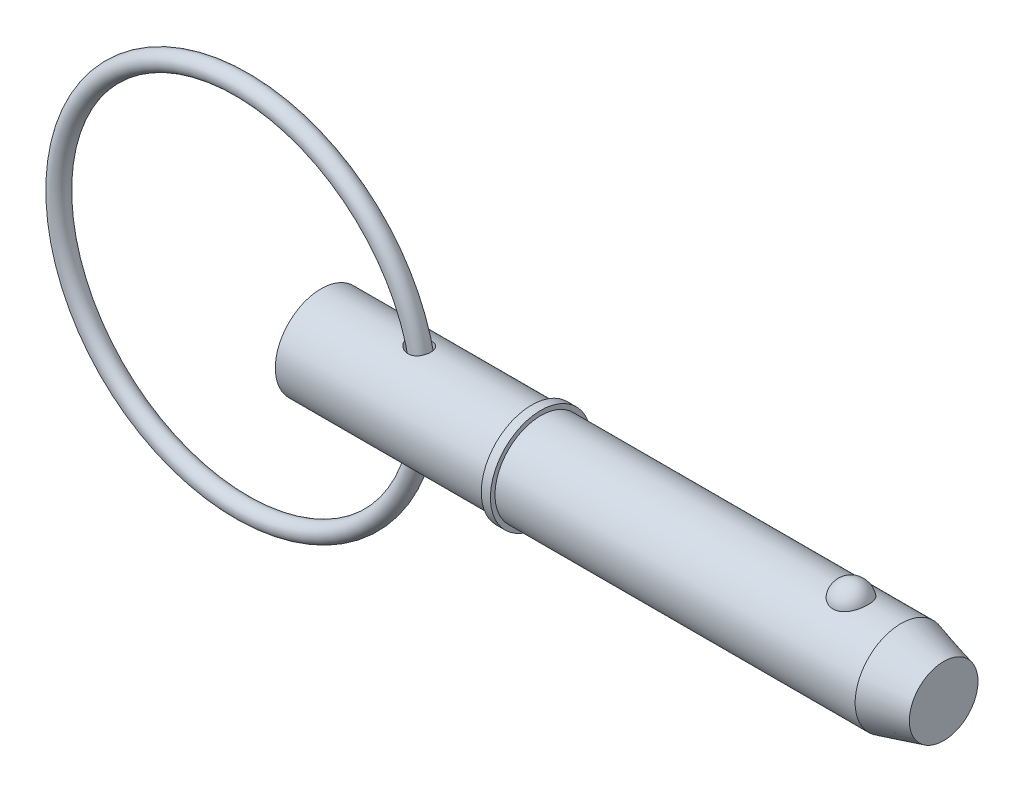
ISO-10303-21;
HEADER;
FILE_DESCRIPTION(('STEP AP214'),'2;1');
FILE_NAME('part.step','',(''),(''),'','','');
FILE_SCHEMA(('AUTOMOTIVE_DESIGN { 1 0 10303 214 1 1 1 1 }'));
ENDSEC;
DATA;
#1=APPLICATION_CONTEXT('core data for automotive mechanical design processes');
#2=APPLICATION_PROTOCOL_DEFINITION('international standard','automotive_design',2000,#1);
#3=PRODUCT_CONTEXT('',#1,'mechanical');
#4=PRODUCT('Part','Part','',(#3));
#5=PRODUCT_RELATED_PRODUCT_CATEGORY('part','',(#4));
#6=PRODUCT_DEFINITION_FORMATION('','',#4);
#7=PRODUCT_DEFINITION_CONTEXT('part definition',#1,'design');
#8=PRODUCT_DEFINITION('design','',#6,#7);
#9=PRODUCT_DEFINITION_SHAPE('','',#8);
#10=(LENGTH_UNIT() NAMED_UNIT(*) SI_UNIT(.MILLI.,.METRE.));
#11=(NAMED_UNIT(*) PLANE_ANGLE_UNIT() SI_UNIT($,.RADIAN.));
#12=(NAMED_UNIT(*) SI_UNIT($,.STERADIAN.) SOLID_ANGLE_UNIT());
#13=UNCERTAINTY_MEASURE_WITH_UNIT(LENGTH_MEASURE(1.E-05),#10,'distance_accuracy_value','');
#14=(GEOMETRIC_REPRESENTATION_CONTEXT(3) GLOBAL_UNCERTAINTY_ASSIGNED_CONTEXT((#13)) GLOBAL_UNIT_ASSIGNED_CONTEXT((#10,
#11,#12)) REPRESENTATION_CONTEXT('',''));
#15=CARTESIAN_POINT('',(0.,0.,0.));
#16=DIRECTION('',(0.,0.,1.));
#17=DIRECTION('',(1.,0.,0.));
#18=AXIS2_PLACEMENT_3D('',#15,#16,#17);
#19=CARTESIAN_POINT('',(-6.86864682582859,0.,0.));
#20=DIRECTION('',(0.,0.,1.));
#21=DIRECTION('',(1.,0.,0.));
#22=AXIS2_PLACEMENT_3D('',#19,#20,#21);
#23=TOROIDAL_SURFACE('',#22,15.875,0.794);
#24=CARTESIAN_POINT('',(9.80035317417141,0.,0.));
#25=VERTEX_POINT('',#24);
#26=VERTEX_LOOP('',#25);
#27=FACE_BOUND('',#26,.T.);
#28=ADVANCED_FACE('P0_F12',(#27),#23,.T.);
#29=CLOSED_SHELL('',(#28));
#30=MANIFOLD_SOLID_BREP('P0_B1',#29);
#31=CARTESIAN_POINT('',(0.,0.,0.));
#32=DIRECTION('',(1.,0.,0.));
#33=DIRECTION('',(0.,0.,-1.));
#34=AXIS2_PLACEMENT_3D('',#31,#32,#33);
#35=CYLINDRICAL_SURFACE('',#34,3.97);
#36=CARTESIAN_POINT('',(7.55504033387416,3.95240335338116,-0.373373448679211));
#37=CARTESIAN_POINT('',(7.57857626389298,3.94742764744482,-0.426034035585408));
#38=CARTESIAN_POINT('',(7.60690043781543,3.94158882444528,-0.476521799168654));
#39=CARTESIAN_POINT('',(7.67175252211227,3.92889627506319,-0.571840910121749));
#40=CARTESIAN_POINT('',(7.70829717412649,3.92204048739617,-0.616660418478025));
#41=CARTESIAN_POINT('',(7.7880127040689,3.90811378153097,-0.699502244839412));
#42=CARTESIAN_POINT('',(7.83115323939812,3.90104396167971,-0.737554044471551));
#43=CARTESIAN_POINT('',(7.92290500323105,3.88739302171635,-0.806417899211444));
#44=CARTESIAN_POINT('',(7.97151503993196,3.88081179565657,-0.837231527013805));
#45=CARTESIAN_POINT('',(8.07649084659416,3.86840671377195,-0.89285990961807));
#46=CARTESIAN_POINT('',(8.13315921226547,3.86266475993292,-0.917124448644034));
#47=CARTESIAN_POINT('',(8.249903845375,3.85323449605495,-0.95597423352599));
#48=CARTESIAN_POINT('',(8.30998046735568,3.84954640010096,-0.970558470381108));
#49=CARTESIAN_POINT('',(8.43159099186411,3.84477321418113,-0.989300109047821));
#50=CARTESIAN_POINT('',(8.49311729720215,3.84367671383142,-0.993503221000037));
#51=CARTESIAN_POINT('',(8.61594280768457,3.84429915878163,-0.991094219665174));
#52=CARTESIAN_POINT('',(8.67724211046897,3.84601670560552,-0.984487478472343));
#53=CARTESIAN_POINT('',(8.79355089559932,3.85191689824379,-0.961127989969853));
#54=CARTESIAN_POINT('',(8.84870898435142,3.85593011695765,-0.945070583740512));
#55=CARTESIAN_POINT('',(8.95525145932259,3.86583609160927,-0.903692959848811));
#56=CARTESIAN_POINT('',(9.00663668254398,3.87172842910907,-0.878374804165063));
#57=CARTESIAN_POINT('',(9.101933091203,3.88440641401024,-0.820440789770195));
#58=CARTESIAN_POINT('',(9.14607052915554,3.89114280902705,-0.788185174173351));
#59=CARTESIAN_POINT('',(9.22823149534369,3.90493885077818,-0.71671042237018));
#60=CARTESIAN_POINT('',(9.26625504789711,3.91199849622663,-0.677491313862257));
#61=CARTESIAN_POINT('',(9.33526828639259,3.92567450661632,-0.59313132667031));
#62=CARTESIAN_POINT('',(9.36624800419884,3.93229023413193,-0.547982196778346));
#63=CARTESIAN_POINT('',(9.42036305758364,3.94435299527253,-0.453062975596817));
#64=CARTESIAN_POINT('',(9.44349799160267,3.94979996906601,-0.403292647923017));
#65=CARTESIAN_POINT('',(9.48161154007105,3.95900091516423,-0.299892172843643));
#66=CARTESIAN_POINT('',(9.49648966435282,3.96273393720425,-0.246223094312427));
#67=CARTESIAN_POINT('',(9.51731386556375,3.96800895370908,-0.137074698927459));
#68=CARTESIAN_POINT('',(9.52325977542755,3.9695509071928,-0.0815953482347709));
#69=CARTESIAN_POINT('',(9.52608552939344,3.97028010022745,0.0297918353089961));
#70=CARTESIAN_POINT('',(9.52293563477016,3.96945961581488,0.0857004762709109));
#71=CARTESIAN_POINT('',(9.5075790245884,3.96553529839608,0.196178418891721));
#72=CARTESIAN_POINT('',(9.49537214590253,3.96243142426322,0.25074769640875));
#73=CARTESIAN_POINT('',(9.46218733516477,3.95427513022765,0.357000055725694));
#74=CARTESIAN_POINT('',(9.44120904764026,3.94922263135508,0.40868302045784));
#75=CARTESIAN_POINT('',(9.39097869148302,3.93771960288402,0.507691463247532));
#76=CARTESIAN_POINT('',(9.36172655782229,3.93126906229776,0.555016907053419));
#77=CARTESIAN_POINT('',(9.29572260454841,3.9176964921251,0.643874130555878));
#78=CARTESIAN_POINT('',(9.25898413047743,3.91057566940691,0.685416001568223));
#79=CARTESIAN_POINT('',(9.1789232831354,3.89645576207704,0.761601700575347));
#80=CARTESIAN_POINT('',(9.13560164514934,3.88945666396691,0.79624629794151));
#81=CARTESIAN_POINT('',(9.04406003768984,3.87645097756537,0.857319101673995));
#82=CARTESIAN_POINT('',(8.99589768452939,3.87043453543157,0.883831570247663));
#83=CARTESIAN_POINT('',(8.89567287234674,3.85997577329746,0.928447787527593));
#84=CARTESIAN_POINT('',(8.84361081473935,3.85553329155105,0.946552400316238));
#85=CARTESIAN_POINT('',(8.73746664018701,3.84871527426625,0.973904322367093));
#86=CARTESIAN_POINT('',(8.68340054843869,3.84632597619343,0.983210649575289));
#87=CARTESIAN_POINT('',(8.57443237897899,3.84376823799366,0.993162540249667));
#88=CARTESIAN_POINT('',(8.51953018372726,3.84360011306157,0.993806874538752));
#89=CARTESIAN_POINT('',(8.40868901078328,3.84546046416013,0.986583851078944));
#90=CARTESIAN_POINT('',(8.35276804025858,3.84755469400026,0.97846170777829));
#91=CARTESIAN_POINT('',(8.24293801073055,3.85374731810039,0.953777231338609));
#92=CARTESIAN_POINT('',(8.18902962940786,3.85784638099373,0.937212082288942));
#93=CARTESIAN_POINT('',(8.08103474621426,3.86789936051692,0.894850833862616));
#94=CARTESIAN_POINT('',(8.02716623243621,3.87395687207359,0.868522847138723));
#95=CARTESIAN_POINT('',(7.92444974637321,3.88711632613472,0.807586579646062));
#96=CARTESIAN_POINT('',(7.87560399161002,3.89421872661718,0.7729746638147));
#97=CARTESIAN_POINT('',(7.7825771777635,3.90895350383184,0.694712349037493));
#98=CARTESIAN_POINT('',(7.73864194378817,3.916595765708,0.650769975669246));
#99=CARTESIAN_POINT('',(7.65930793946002,3.93121788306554,0.555638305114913));
#100=CARTESIAN_POINT('',(7.62390591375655,3.93819799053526,0.504451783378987));
#101=CARTESIAN_POINT('',(7.56512704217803,3.95020492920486,0.399268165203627));
#102=CARTESIAN_POINT('',(7.54117152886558,3.95532161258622,0.345606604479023));
#103=CARTESIAN_POINT('',(7.5037545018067,3.96345177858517,0.234589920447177));
#104=CARTESIAN_POINT('',(7.49028363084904,3.96646713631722,0.177238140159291));
#105=CARTESIAN_POINT('',(7.4756155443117,3.96976030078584,0.0675802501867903));
#106=CARTESIAN_POINT('',(7.47319553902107,3.97031070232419,0.0154431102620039));
#107=CARTESIAN_POINT('',(7.47743162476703,3.96935406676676,-0.0884045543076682));
#108=CARTESIAN_POINT('',(7.48407724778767,3.96784940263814,-0.14011550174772));
#109=CARTESIAN_POINT('',(7.50184406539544,3.96390208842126,-0.222210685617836));
#110=CARTESIAN_POINT('',(7.51030342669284,3.96203347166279,-0.253229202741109));
#111=CARTESIAN_POINT('',(7.53036279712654,3.95766645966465,-0.314179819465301));
#112=CARTESIAN_POINT('',(7.5419623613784,3.9551681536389,-0.344112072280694));
#113=CARTESIAN_POINT('',(7.55504033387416,3.95240335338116,-0.373373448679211));
#114=B_SPLINE_CURVE_WITH_KNOTS('',3,(#36,#37,#38,#39,#40,#41,#42,#43,#44,#45,#46,#47,#48,#49,
#50,#51,#52,#53,#54,#55,#56,#57,#58,#59,#60,#61,#62,#63,#64,#65,#66,#67,#68,#69,#70,#71,#72,#73,
#74,#75,#76,#77,#78,#79,#80,#81,#82,#83,#84,#85,#86,#87,#88,#89,#90,#91,#92,#93,#94,#95,#96,#97,
#98,#99,#100,#101,#102,#103,#104,#105,#106,#107,#108,#109,#110,#111,#112,#113),.UNSPECIFIED.,
.T.,.F.,(4,2,2,2,2,2,2,2,2,2,2,2,2,2,2,2,2,2,2,2,2,2,2,2,2,2,2,2,2,2,2,2,2,2,2,2,2,2,4),(0.,
0.173554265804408,0.347465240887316,0.520599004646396,0.693695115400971,0.878558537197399,
1.0634412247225,1.24750837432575,1.43148407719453,1.60336872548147,1.77521512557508,
1.93967886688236,2.10414195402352,2.26883635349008,2.43353918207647,2.60020488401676,
2.76687370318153,2.93408806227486,3.10130543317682,3.26852958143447,3.43575504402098,
3.60268496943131,3.76959626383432,3.93471461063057,4.0998159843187,4.26380184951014,
4.42781098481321,4.5967184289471,4.76568224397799,4.94567321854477,5.12574332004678,
5.31261375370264,5.49941278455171,5.67537040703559,5.85117081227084,6.00695555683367,
6.16256057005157,6.25901137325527,6.35544851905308),.UNSPECIFIED.);
#115=CARTESIAN_POINT('',(7.55504033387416,3.95240335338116,-0.373373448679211));
#116=VERTEX_POINT('',#115);
#117=EDGE_CURVE('P1_E42',#116,#116,#114,.T.);
#118=ORIENTED_EDGE('',*,*,#117,.T.);
#119=EDGE_LOOP('',(#118));
#120=FACE_BOUND('',#119,.T.);
#121=CARTESIAN_POINT('',(0.,0.,0.));
#122=DIRECTION('',(1.,0.,0.));
#123=DIRECTION('',(0.,0.,-1.));
#124=AXIS2_PLACEMENT_3D('',#121,#122,#123);
#125=CIRCLE('',#124,3.97);
#126=CARTESIAN_POINT('',(0.,0.,-3.97));
#127=VERTEX_POINT('',#126);
#128=EDGE_CURVE('P1_E9',#127,#127,#125,.T.);
#129=ORIENTED_EDGE('',*,*,#128,.T.);
#130=EDGE_LOOP('',(#129));
#131=FACE_BOUND('',#130,.T.);
#132=CARTESIAN_POINT('',(18.256,0.,0.));
#133=DIRECTION('',(1.,0.,0.));
#134=DIRECTION('',(0.,0.,-1.));
#135=AXIS2_PLACEMENT_3D('',#132,#133,#134);
#136=CIRCLE('',#135,3.97);
#137=CARTESIAN_POINT('',(18.256,0.,-3.97));
#138=VERTEX_POINT('',#137);
#139=EDGE_CURVE('P1_E25',#138,#138,#136,.T.);
#140=ORIENTED_EDGE('',*,*,#139,.F.);
#141=EDGE_LOOP('',(#140));
#142=FACE_BOUND('',#141,.T.);
#143=CARTESIAN_POINT('',(7.55504033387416,-3.95240335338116,-0.373373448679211));
#144=CARTESIAN_POINT('',(7.53460920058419,-3.95672239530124,-0.327655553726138));
#145=CARTESIAN_POINT('',(7.51777420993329,-3.96039298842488,-0.280271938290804));
#146=CARTESIAN_POINT('',(7.49205527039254,-3.96606288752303,-0.183298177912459));
#147=CARTESIAN_POINT('',(7.48316724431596,-3.96806305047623,-0.133709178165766));
#148=CARTESIAN_POINT('',(7.47379315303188,-3.9701737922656,-0.0336103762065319));
#149=CARTESIAN_POINT('',(7.47332172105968,-3.97028108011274,0.0169008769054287));
#150=CARTESIAN_POINT('',(7.48084392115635,-3.96858544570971,0.11725681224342));
#151=CARTESIAN_POINT('',(7.48883849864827,-3.96678231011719,0.167101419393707));
#152=CARTESIAN_POINT('',(7.51265320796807,-3.96151492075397,0.263832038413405));
#153=CARTESIAN_POINT('',(7.52833209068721,-3.95808068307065,0.310754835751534));
#154=CARTESIAN_POINT('',(7.56673745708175,-3.94990960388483,0.401487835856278));
#155=CARTESIAN_POINT('',(7.58946563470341,-3.94517244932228,0.44529728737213));
#156=CARTESIAN_POINT('',(7.64284475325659,-3.93448395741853,0.53175081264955));
#157=CARTESIAN_POINT('',(7.67392233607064,-3.92847279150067,0.57412324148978));
#158=CARTESIAN_POINT('',(7.74208866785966,-3.91602761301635,0.653644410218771));
#159=CARTESIAN_POINT('',(7.77918016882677,-3.90959340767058,0.690790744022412));
#160=CARTESIAN_POINT('',(7.86273878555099,-3.89617013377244,0.763056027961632));
#161=CARTESIAN_POINT('',(7.90978795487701,-3.88919756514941,0.797506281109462));
#162=CARTESIAN_POINT('',(8.00882206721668,-3.87616232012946,0.858629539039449));
#163=CARTESIAN_POINT('',(8.06080923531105,-3.87010005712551,0.885299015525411));
#164=CARTESIAN_POINT('',(8.17187138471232,-3.85921766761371,0.931635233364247));
#165=CARTESIAN_POINT('',(8.23118658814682,-3.85449995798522,0.950754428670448));
#166=CARTESIAN_POINT('',(8.35233947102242,-3.84749758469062,0.97871022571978));
#167=CARTESIAN_POINT('',(8.41417663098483,-3.84521242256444,0.987548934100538));
#168=CARTESIAN_POINT('',(8.53665727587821,-3.84349493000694,0.994212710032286));
#169=CARTESIAN_POINT('',(8.59728174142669,-3.84397996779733,0.99235677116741));
#170=CARTESIAN_POINT('',(8.71718393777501,-3.84764343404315,0.978056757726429));
#171=CARTESIAN_POINT('',(8.77646227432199,-3.8508206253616,0.965617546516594));
#172=CARTESIAN_POINT('',(8.88778602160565,-3.85921632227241,0.931467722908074));
#173=CARTESIAN_POINT('',(8.94005016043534,-3.864284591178,0.91043061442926));
#174=CARTESIAN_POINT('',(9.04004360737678,-3.87587542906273,0.85974532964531));
#175=CARTESIAN_POINT('',(9.08777352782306,-3.88239780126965,0.830098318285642));
#176=CARTESIAN_POINT('',(9.17600506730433,-3.895934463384,0.763999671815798));
#177=CARTESIAN_POINT('',(9.21667512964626,-3.90292920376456,0.727768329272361));
#178=CARTESIAN_POINT('',(9.29136502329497,-3.91679963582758,0.648981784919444));
#179=CARTESIAN_POINT('',(9.32538470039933,-3.92367532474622,0.606426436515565));
#180=CARTESIAN_POINT('',(9.38618865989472,-3.9366168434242,0.515806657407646));
#181=CARTESIAN_POINT('',(9.4129117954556,-3.9426756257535,0.467700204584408));
#182=CARTESIAN_POINT('',(9.45812227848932,-3.95326415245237,0.367605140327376));
#183=CARTESIAN_POINT('',(9.47660924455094,-3.95779382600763,0.315616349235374));
#184=CARTESIAN_POINT('',(9.50505994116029,-3.96487773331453,0.208669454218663));
#185=CARTESIAN_POINT('',(9.51493710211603,-3.96741187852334,0.153686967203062));
#186=CARTESIAN_POINT('',(9.52562221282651,-3.97015680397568,0.0427905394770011));
#187=CARTESIAN_POINT('',(9.52643004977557,-3.97036755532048,-0.0131234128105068));
#188=CARTESIAN_POINT('',(9.51895215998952,-3.96844170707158,-0.124381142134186));
#189=CARTESIAN_POINT('',(9.51065320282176,-3.96630169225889,-0.179723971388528));
#190=CARTESIAN_POINT('',(9.48513477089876,-3.95989913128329,-0.288186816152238));
#191=CARTESIAN_POINT('',(9.46791509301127,-3.95563653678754,-0.341306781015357));
#192=CARTESIAN_POINT('',(9.42495956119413,-3.94545061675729,-0.443818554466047));
#193=CARTESIAN_POINT('',(9.39922309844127,-3.93952717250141,-0.493210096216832));
#194=CARTESIAN_POINT('',(9.33985370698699,-3.92667071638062,-0.586850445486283));
#195=CARTESIAN_POINT('',(9.30622091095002,-3.91973772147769,-0.631099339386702));
#196=CARTESIAN_POINT('',(9.23204774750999,-3.9056660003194,-0.713019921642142));
#197=CARTESIAN_POINT('',(9.19153441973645,-3.89852816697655,-0.750716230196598));
#198=CARTESIAN_POINT('',(9.10459278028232,-3.88483152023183,-0.818650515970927));
#199=CARTESIAN_POINT('',(9.05816529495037,-3.87827262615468,-0.848889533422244));
#200=CARTESIAN_POINT('',(8.96131655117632,-3.86655481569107,-0.900752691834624));
#201=CARTESIAN_POINT('',(8.91095192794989,-3.86137955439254,-0.922478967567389));
#202=CARTESIAN_POINT('',(8.8071927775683,-3.85288425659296,-0.957343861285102));
#203=CARTESIAN_POINT('',(8.75379837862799,-3.84956414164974,-0.97048284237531));
#204=CARTESIAN_POINT('',(8.64548182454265,-3.84510108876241,-0.988018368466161));
#205=CARTESIAN_POINT('',(8.59055875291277,-3.84395948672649,-0.992409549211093));
#206=CARTESIAN_POINT('',(8.48070473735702,-3.84391315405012,-0.992587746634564));
#207=CARTESIAN_POINT('',(8.42577379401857,-3.84500886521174,-0.988373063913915));
#208=CARTESIAN_POINT('',(8.31494327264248,-3.84934404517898,-0.971354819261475));
#209=CARTESIAN_POINT('',(8.25910274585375,-3.85267319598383,-0.958191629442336));
#210=CARTESIAN_POINT('',(8.15023512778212,-3.86114252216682,-0.923469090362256));
#211=CARTESIAN_POINT('',(8.09720922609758,-3.86628345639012,-0.901906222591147));
#212=CARTESIAN_POINT('',(7.9918189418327,-3.87819313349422,-0.849289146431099));
#213=CARTESIAN_POINT('',(7.93972943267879,-3.88504694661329,-0.817702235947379));
#214=CARTESIAN_POINT('',(7.84154327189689,-3.89937910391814,-0.746366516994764));
#215=CARTESIAN_POINT('',(7.79544783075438,-3.90685757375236,-0.706616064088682));
#216=CARTESIAN_POINT('',(7.71208259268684,-3.92134227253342,-0.621122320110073));
#217=CARTESIAN_POINT('',(7.67457985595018,-3.92835595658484,-0.57560820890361));
#218=CARTESIAN_POINT('',(7.60807883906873,-3.94134589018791,-0.478617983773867));
#219=CARTESIAN_POINT('',(7.57907194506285,-3.94732318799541,-0.427147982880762));
#220=CARTESIAN_POINT('',(7.55504033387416,-3.95240335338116,-0.373373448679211));
#221=B_SPLINE_CURVE_WITH_KNOTS('',3,(#143,#144,#145,#146,#147,#148,#149,#150,#151,#152,#153,
#154,#155,#156,#157,#158,#159,#160,#161,#162,#163,#164,#165,#166,#167,#168,#169,#170,#171,#172,
#173,#174,#175,#176,#177,#178,#179,#180,#181,#182,#183,#184,#185,#186,#187,#188,#189,#190,#191,
#192,#193,#194,#195,#196,#197,#198,#199,#200,#201,#202,#203,#204,#205,#206,#207,#208,#209,#210,
#211,#212,#213,#214,#215,#216,#217,#218,#219,#220),.UNSPECIFIED.,.T.,.F.,(4,2,2,2,2,2,2,2,2,2,2,
2,2,2,2,2,2,2,2,2,2,2,2,2,2,2,2,2,2,2,2,2,2,2,2,2,2,2,4),(0.,0.150601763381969,
0.301126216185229,0.451912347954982,0.602715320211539,0.750844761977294,0.899009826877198,
1.05703657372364,1.21513583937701,1.39056726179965,1.56607811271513,1.75265499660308,
1.93919364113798,2.12019769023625,2.30111860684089,2.46997605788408,2.63881067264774,
2.80278822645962,2.96676958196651,3.13208567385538,3.29740942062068,3.46437689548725,
3.63134644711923,3.79855889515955,3.96577515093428,4.13300336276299,4.30022876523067,
4.46681158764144,4.63337115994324,4.79786624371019,4.96235437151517,5.12694333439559,
5.29156480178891,5.46322695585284,5.63496109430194,5.81803489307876,6.00114560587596,
6.1784675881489,6.35560915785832),.UNSPECIFIED.);
#222=CARTESIAN_POINT('',(7.55504033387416,-3.95240335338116,-0.373373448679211));
#223=VERTEX_POINT('',#222);
#224=EDGE_CURVE('P1_E17',#223,#223,#221,.T.);
#225=ORIENTED_EDGE('',*,*,#224,.T.);
#226=EDGE_LOOP('',(#225));
#227=FACE_BOUND('',#226,.T.);
#228=ADVANCED_FACE('P1_F13',(#120,#131,#142,#227),#35,.T.);
#229=CARTESIAN_POINT('',(0.,0.,0.));
#230=DIRECTION('',(1.,0.,0.));
#231=DIRECTION('',(0.,0.,-1.));
#232=AXIS2_PLACEMENT_3D('',#229,#230,#231);
#233=CYLINDRICAL_SURFACE('',#232,3.97);
#234=CARTESIAN_POINT('',(50.2759395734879,0.,0.));
#235=DIRECTION('',(1.,0.,0.));
#236=DIRECTION('',(0.,0.,-1.));
#237=AXIS2_PLACEMENT_3D('',#234,#235,#236);
#238=CIRCLE('',#237,3.97);
#239=CARTESIAN_POINT('',(50.2759395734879,0.,-3.97));
#240=VERTEX_POINT('',#239);
#241=EDGE_CURVE('P1_E99',#240,#240,#238,.T.);
#242=ORIENTED_EDGE('',*,*,#241,.F.);
#243=EDGE_LOOP('',(#242));
#244=FACE_BOUND('',#243,.T.);
#245=CARTESIAN_POINT('',(19.05,0.,0.));
#246=DIRECTION('',(1.,0.,0.));
#247=DIRECTION('',(0.,0.,-1.));
#248=AXIS2_PLACEMENT_3D('',#245,#246,#247);
#249=CIRCLE('',#248,3.97);
#250=CARTESIAN_POINT('',(19.05,0.,-3.97));
#251=VERTEX_POINT('',#250);
#252=EDGE_CURVE('P1_E96',#251,#251,#249,.T.);
#253=ORIENTED_EDGE('',*,*,#252,.T.);
#254=EDGE_LOOP('',(#253));
#255=FACE_BOUND('',#254,.T.);
#256=CARTESIAN_POINT('',(45.9451922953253,3.65715365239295,1.54470941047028));
#257=CARTESIAN_POINT('',(45.8652448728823,3.65716001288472,1.54470290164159));
#258=CARTESIAN_POINT('',(45.7851650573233,3.65987074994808,1.53832549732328));
#259=CARTESIAN_POINT('',(45.6272374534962,3.6704221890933,1.51297018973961));
#260=CARTESIAN_POINT('',(45.5493961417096,3.67827646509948,1.49395894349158));
#261=CARTESIAN_POINT('',(45.3984614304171,3.69818848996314,1.44395950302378));
#262=CARTESIAN_POINT('',(45.3253560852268,3.71023513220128,1.41300293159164));
#263=CARTESIAN_POINT('',(45.1855630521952,3.7372183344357,1.34000212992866));
#264=CARTESIAN_POINT('',(45.1188725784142,3.75215363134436,1.29796274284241));
#265=CARTESIAN_POINT('',(44.9914886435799,3.78384968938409,1.20248834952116));
#266=CARTESIAN_POINT('',(44.9310299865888,3.80065129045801,1.14875388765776));
#267=CARTESIAN_POINT('',(44.8196942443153,3.83398532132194,1.03205417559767));
#268=CARTESIAN_POINT('',(44.7688200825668,3.85051766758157,0.969086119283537));
#269=CARTESIAN_POINT('',(44.6756321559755,3.88238608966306,0.832526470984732));
#270=CARTESIAN_POINT('',(44.6337961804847,3.89763698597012,0.758588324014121));
#271=CARTESIAN_POINT('',(44.5625108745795,3.92451063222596,0.60435211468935));
#272=CARTESIAN_POINT('',(44.5330623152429,3.93613315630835,0.524053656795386));
#273=CARTESIAN_POINT('',(44.4868927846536,3.95467606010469,0.358403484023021));
#274=CARTESIAN_POINT('',(44.4703127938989,3.96154426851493,0.273006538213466));
#275=CARTESIAN_POINT('',(44.450756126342,3.96967008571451,0.100408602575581));
#276=CARTESIAN_POINT('',(44.4477789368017,3.97092790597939,0.0132076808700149));
#277=CARTESIAN_POINT('',(44.4554587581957,3.96771794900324,-0.159844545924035));
#278=CARTESIAN_POINT('',(44.4660164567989,3.96329187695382,-0.245701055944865));
#279=CARTESIAN_POINT('',(44.5003800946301,3.94923163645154,-0.414277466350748));
#280=CARTESIAN_POINT('',(44.5241862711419,3.93959737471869,-0.496997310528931));
#281=CARTESIAN_POINT('',(44.5846114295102,3.91607752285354,-0.657113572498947));
#282=CARTESIAN_POINT('',(44.6212495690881,3.90218558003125,-0.734501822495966));
#283=CARTESIAN_POINT('',(44.7065935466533,3.87158287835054,-0.881704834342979));
#284=CARTESIAN_POINT('',(44.7553004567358,3.8548718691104,-0.951518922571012));
#285=CARTESIAN_POINT('',(44.8641161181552,3.82028735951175,-1.08208159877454));
#286=CARTESIAN_POINT('',(44.9242955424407,3.80240713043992,-1.14276958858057));
#287=CARTESIAN_POINT('',(45.054493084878,3.76758161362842,-1.2528243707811));
#288=CARTESIAN_POINT('',(45.1245105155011,3.75063626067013,-1.30219195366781));
#289=CARTESIAN_POINT('',(45.27118160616,3.71998948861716,-1.38729709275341));
#290=CARTESIAN_POINT('',(45.3476813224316,3.70623183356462,-1.42327904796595));
#291=CARTESIAN_POINT('',(45.5062981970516,3.68323188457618,-1.48178996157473));
#292=CARTESIAN_POINT('',(45.5884132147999,3.67398788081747,-1.5043240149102));
#293=CARTESIAN_POINT('',(45.7514810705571,3.6615216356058,-1.53440939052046));
#294=CARTESIAN_POINT('',(45.8322840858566,3.65801951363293,-1.54265826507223));
#295=CARTESIAN_POINT('',(45.9942085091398,3.65657341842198,-1.54608423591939));
#296=CARTESIAN_POINT('',(46.0753298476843,3.65862829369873,-1.54126404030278));
#297=CARTESIAN_POINT('',(46.2328122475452,3.66788969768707,-1.51908474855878));
#298=CARTESIAN_POINT('',(46.3092422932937,3.67492621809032,-1.50213925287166));
#299=CARTESIAN_POINT('',(46.4580412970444,3.69318404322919,-1.45666982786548));
#300=CARTESIAN_POINT('',(46.5304099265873,3.70440568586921,-1.42814496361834));
#301=CARTESIAN_POINT('',(46.6708029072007,3.73012749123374,-1.35956319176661));
#302=CARTESIAN_POINT('',(46.7387000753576,3.74469307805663,-1.31927107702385));
#303=CARTESIAN_POINT('',(46.8668649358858,3.77545272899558,-1.22847440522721));
#304=CARTESIAN_POINT('',(46.9271308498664,3.79164717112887,-1.17796747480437));
#305=CARTESIAN_POINT('',(47.0416346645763,3.82490325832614,-1.06519260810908));
#306=CARTESIAN_POINT('',(47.0954137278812,3.84196735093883,-1.00245914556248));
#307=CARTESIAN_POINT('',(47.1920988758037,3.87439863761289,-0.868715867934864));
#308=CARTESIAN_POINT('',(47.2350030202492,3.88976552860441,-0.797704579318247));
#309=CARTESIAN_POINT('',(47.310266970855,3.91771381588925,-0.646896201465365));
#310=CARTESIAN_POINT('',(47.3422532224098,3.93019255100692,-0.566893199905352));
#311=CARTESIAN_POINT('',(47.3931101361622,3.95043886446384,-0.40225513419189));
#312=CARTESIAN_POINT('',(47.4119807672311,3.95820643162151,-0.317620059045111));
#313=CARTESIAN_POINT('',(47.4362162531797,3.96823733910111,-0.14615699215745));
#314=CARTESIAN_POINT('',(47.4415874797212,3.970503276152,-0.0593300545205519));
#315=CARTESIAN_POINT('',(47.4387309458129,3.96930811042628,0.114057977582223));
#316=CARTESIAN_POINT('',(47.4305035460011,3.9658471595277,0.200619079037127));
#317=CARTESIAN_POINT('',(47.4007063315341,3.95358562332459,0.370506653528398));
#318=CARTESIAN_POINT('',(47.3792129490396,3.94481563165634,0.453848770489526));
#319=CARTESIAN_POINT('',(47.3233839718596,3.92284586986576,0.615497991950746));
#320=CARTESIAN_POINT('',(47.2890474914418,3.90964579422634,0.693804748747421));
#321=CARTESIAN_POINT('',(47.2079702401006,3.88006987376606,0.843703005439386));
#322=CARTESIAN_POINT('',(47.1611536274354,3.86367478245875,0.915249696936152));
#323=CARTESIAN_POINT('',(47.0561897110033,3.82949741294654,1.04910810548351));
#324=CARTESIAN_POINT('',(46.9980428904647,3.81171519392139,1.11142021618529));
#325=CARTESIAN_POINT('',(46.8717433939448,3.77673366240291,1.22503948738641));
#326=CARTESIAN_POINT('',(46.8035970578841,3.75953398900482,1.27635357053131));
#327=CARTESIAN_POINT('',(46.6589009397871,3.72770506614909,1.36653336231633));
#328=CARTESIAN_POINT('',(46.582348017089,3.71307678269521,1.40539439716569));
#329=CARTESIAN_POINT('',(46.4257594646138,3.68864287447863,1.46830480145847));
#330=CARTESIAN_POINT('',(46.3459307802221,3.67869017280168,1.49281289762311));
#331=CARTESIAN_POINT('',(46.1829877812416,3.66414535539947,1.52817474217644));
#332=CARTESIAN_POINT('',(46.0998840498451,3.65953723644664,1.53906926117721));
#333=CARTESIAN_POINT('',(45.9927760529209,3.6573894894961,1.54414878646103));
#334=CARTESIAN_POINT('',(45.9689900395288,3.65715175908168,1.54471134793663));
#335=CARTESIAN_POINT('',(45.9451922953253,3.65715365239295,1.54470941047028));
#336=B_SPLINE_CURVE_WITH_KNOTS('',3,(#256,#257,#258,#259,#260,#261,#262,#263,#264,#265,#266,
#267,#268,#269,#270,#271,#272,#273,#274,#275,#276,#277,#278,#279,#280,#281,#282,#283,#284,#285,
#286,#287,#288,#289,#290,#291,#292,#293,#294,#295,#296,#297,#298,#299,#300,#301,#302,#303,#304,
#305,#306,#307,#308,#309,#310,#311,#312,#313,#314,#315,#316,#317,#318,#319,#320,#321,#322,#323,
#324,#325,#326,#327,#328,#329,#330,#331,#332,#333,#334,#335),.UNSPECIFIED.,.T.,.F.,(4,2,2,2,2,2,
2,2,2,2,2,2,2,2,2,2,2,2,2,2,2,2,2,2,2,2,2,2,2,2,2,2,2,2,2,2,2,2,2,4),(0.,0.239777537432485,
0.480190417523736,0.719971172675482,0.959647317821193,1.20639040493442,1.45320863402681,
1.7109367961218,1.96868099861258,2.22921052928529,2.48973023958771,2.74834928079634,
3.00697295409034,3.26598440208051,3.52501886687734,3.78570385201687,4.04637062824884,
4.30201257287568,4.55755760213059,4.80022994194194,5.04285200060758,5.27757006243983,
5.51230707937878,5.75210128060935,5.99195126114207,6.24392810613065,6.49594987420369,
6.75588818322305,7.01582710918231,7.27564332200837,7.53545264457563,7.79377886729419,
8.0521229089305,8.31207418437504,8.57201437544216,8.83179046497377,9.09166393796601,
9.34270057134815,9.59298357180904,9.66435753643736),.UNSPECIFIED.);
#337=CARTESIAN_POINT('',(45.9451922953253,3.65715365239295,1.54470941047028));
#338=VERTEX_POINT('',#337);
#339=EDGE_CURVE('P1_E34',#338,#338,#336,.T.);
#340=ORIENTED_EDGE('',*,*,#339,.T.);
#341=EDGE_LOOP('',(#340));
#342=FACE_BOUND('',#341,.T.);
#343=ADVANCED_FACE('P1_F46',(#244,#255,#342),#233,.T.);
#344=CARTESIAN_POINT('',(0.,0.,0.));
#345=DIRECTION('',(-1.,0.,0.));
#346=DIRECTION('',(0.,0.,1.));
#347=AXIS2_PLACEMENT_3D('',#344,#345,#346);
#348=PLANE('',#347);
#349=ORIENTED_EDGE('',*,*,#128,.F.);
#350=EDGE_LOOP('',(#349));
#351=FACE_BOUND('',#350,.T.);
#352=ADVANCED_FACE('P1_F15',(#351),#348,.T.);
#353=CARTESIAN_POINT('',(18.256,3.97,0.));
#354=DIRECTION('',(-1.,0.,0.));
#355=DIRECTION('',(0.,0.,1.));
#356=AXIS2_PLACEMENT_3D('',#353,#354,#355);
#357=PLANE('',#356);
#358=ORIENTED_EDGE('',*,*,#139,.T.);
#359=EDGE_LOOP('',(#358));
#360=FACE_BOUND('',#359,.T.);
#361=CARTESIAN_POINT('',(18.256,0.,0.));
#362=DIRECTION('',(1.,0.,0.));
#363=DIRECTION('',(0.,0.,-1.));
#364=AXIS2_PLACEMENT_3D('',#361,#362,#363);
#365=CIRCLE('',#364,4.367);
#366=CARTESIAN_POINT('',(18.256,0.,-4.367));
#367=VERTEX_POINT('',#366);
#368=EDGE_CURVE('P1_E30',#367,#367,#365,.T.);
#369=ORIENTED_EDGE('',*,*,#368,.F.);
#370=EDGE_LOOP('',(#369));
#371=FACE_BOUND('',#370,.T.);
#372=ADVANCED_FACE('P1_F81',(#360,#371),#357,.T.);
#373=CARTESIAN_POINT('',(0.,0.,0.));
#374=DIRECTION('',(1.,0.,0.));
#375=DIRECTION('',(0.,0.,-1.));
#376=AXIS2_PLACEMENT_3D('',#373,#374,#375);
#377=CYLINDRICAL_SURFACE('',#376,4.367);
#378=ORIENTED_EDGE('',*,*,#368,.T.);
#379=EDGE_LOOP('',(#378));
#380=FACE_BOUND('',#379,.T.);
#381=CARTESIAN_POINT('',(19.05,0.,0.));
#382=DIRECTION('',(1.,0.,0.));
#383=DIRECTION('',(0.,0.,-1.));
#384=AXIS2_PLACEMENT_3D('',#381,#382,#383);
#385=CIRCLE('',#384,4.367);
#386=CARTESIAN_POINT('',(19.05,0.,-4.367));
#387=VERTEX_POINT('',#386);
#388=EDGE_CURVE('P1_E95',#387,#387,#385,.T.);
#389=ORIENTED_EDGE('',*,*,#388,.F.);
#390=EDGE_LOOP('',(#389));
#391=FACE_BOUND('',#390,.T.);
#392=ADVANCED_FACE('P1_F68',(#380,#391),#377,.T.);
#393=CARTESIAN_POINT('',(19.05,4.367,0.));
#394=DIRECTION('',(1.,0.,0.));
#395=DIRECTION('',(0.,0.,-1.));
#396=AXIS2_PLACEMENT_3D('',#393,#394,#395);
#397=PLANE('',#396);
#398=ORIENTED_EDGE('',*,*,#388,.T.);
#399=EDGE_LOOP('',(#398));
#400=FACE_BOUND('',#399,.T.);
#401=ORIENTED_EDGE('',*,*,#252,.F.);
#402=EDGE_LOOP('',(#401));
#403=FACE_BOUND('',#402,.T.);
#404=ADVANCED_FACE('P1_F62',(#400,#403),#397,.T.);
#405=CARTESIAN_POINT('',(53.98,0.,0.));
#406=DIRECTION('',(-1.,0.,0.));
#407=DIRECTION('',(0.,0.,1.));
#408=AXIS2_PLACEMENT_3D('',#405,#406,#407);
#409=CONICAL_SURFACE('',#408,2.97750000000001,0.26179938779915);
#410=ORIENTED_EDGE('',*,*,#241,.T.);
#411=EDGE_LOOP('',(#410));
#412=FACE_BOUND('',#411,.T.);
#413=CARTESIAN_POINT('',(53.98,0.,0.));
#414=DIRECTION('',(1.,0.,0.));
#415=DIRECTION('',(0.,0.,-1.));
#416=AXIS2_PLACEMENT_3D('',#413,#414,#415);
#417=CIRCLE('',#416,2.97750000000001);
#418=CARTESIAN_POINT('',(53.98,0.,-2.97750000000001));
#419=VERTEX_POINT('',#418);
#420=EDGE_CURVE('P1_E41',#419,#419,#417,.T.);
#421=ORIENTED_EDGE('',*,*,#420,.F.);
#422=EDGE_LOOP('',(#421));
#423=FACE_BOUND('',#422,.T.);
#424=ADVANCED_FACE('P1_F59',(#412,#423),#409,.T.);
#425=CARTESIAN_POINT('',(53.98,2.97750000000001,0.));
#426=DIRECTION('',(1.,0.,0.));
#427=DIRECTION('',(0.,0.,-1.));
#428=AXIS2_PLACEMENT_3D('',#425,#426,#427);
#429=PLANE('',#428);
#430=ORIENTED_EDGE('',*,*,#420,.T.);
#431=EDGE_LOOP('',(#430));
#432=FACE_BOUND('',#431,.T.);
#433=ADVANCED_FACE('P1_F55',(#432),#429,.T.);
#434=CARTESIAN_POINT('',(45.9451922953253,3.573,0.));
#435=DIRECTION('',(-1.,0.,0.));
#436=DIRECTION('',(0.,1.,0.));
#437=AXIS2_PLACEMENT_3D('',#434,#435,#436);
#438=SPHERICAL_SURFACE('',#437,1.54699999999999);
#439=ORIENTED_EDGE('',*,*,#339,.F.);
#440=EDGE_LOOP('',(#439));
#441=FACE_BOUND('',#440,.T.);
#442=ADVANCED_FACE('P1_F50',(#441),#438,.T.);
#443=CARTESIAN_POINT('',(-6.86864682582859,0.,0.));
#444=DIRECTION('',(0.,0.,1.));
#445=DIRECTION('',(1.,0.,0.));
#446=AXIS2_PLACEMENT_3D('',#443,#444,#445);
#447=TOROIDAL_SURFACE('',#446,15.875,0.9925);
#448=ORIENTED_EDGE('',*,*,#224,.F.);
#449=EDGE_LOOP('',(#448));
#450=FACE_BOUND('',#449,.T.);
#451=ORIENTED_EDGE('',*,*,#117,.F.);
#452=EDGE_LOOP('',(#451));
#453=FACE_BOUND('',#452,.T.);
#454=ADVANCED_FACE('P1_F54',(#450,#453),#447,.F.);
#455=CLOSED_SHELL('',(#228,#343,#352,#372,#392,#404,#424,#433,#442,#454));
#456=MANIFOLD_SOLID_BREP('P1_B1',#455);
#457=ADVANCED_BREP_SHAPE_REPRESENTATION('',(#18,#30,#456),#14);
#458=SHAPE_DEFINITION_REPRESENTATION(#9,#457);
ENDSEC;
END-ISO-10303-21;
